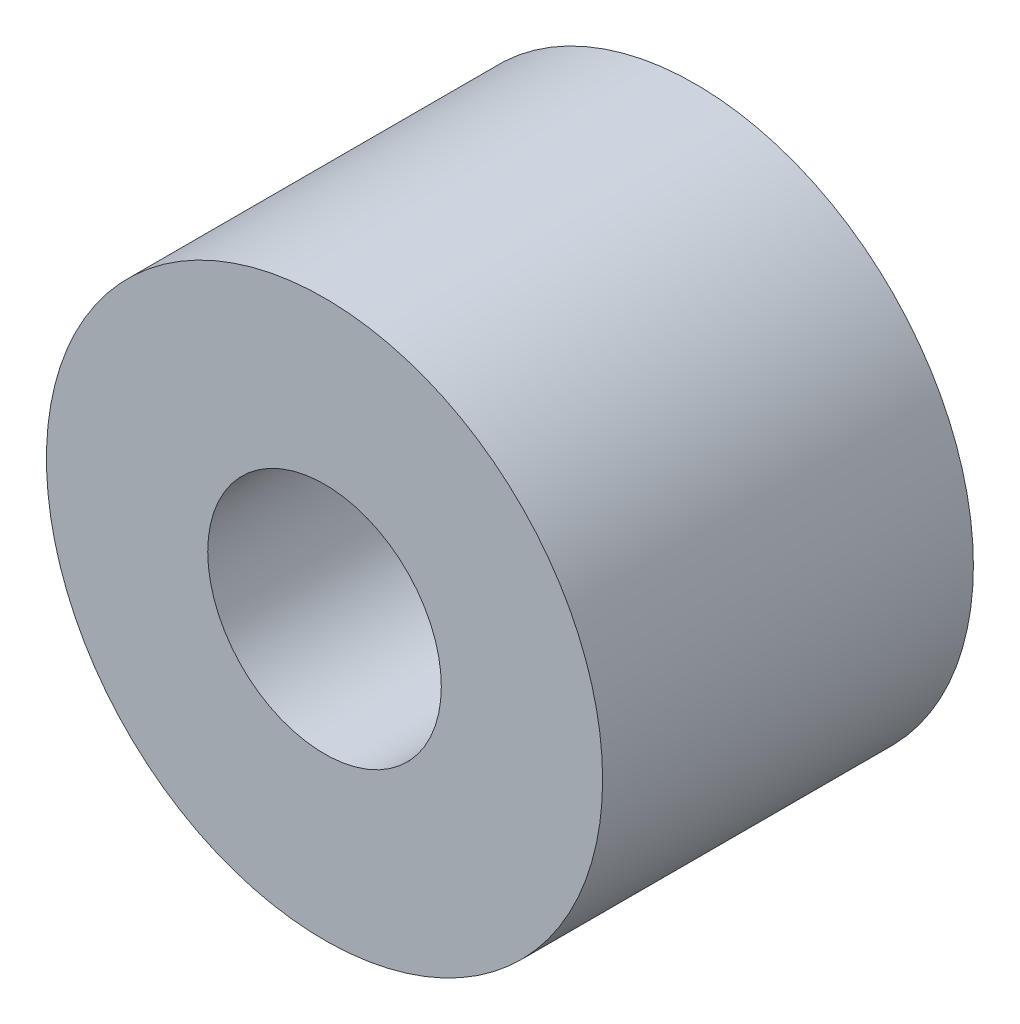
from build123d import *

# Parameters (mm, degrees)
SKETCH1_R           = 9.525
SKETCH1_R_2         = 4.0005
BOSS_EXTRUDE1_DEPTH = 12.7


with BuildPart() as part:
    # Sketch1 → Boss-Extrude1 (new body)
    with BuildSketch(Plane.XY):
        Circle(SKETCH1_R)
        Circle(SKETCH1_R_2, mode=Mode.SUBTRACT)
    extrude(amount=BOSS_EXTRUDE1_DEPTH)


solid = part.part
